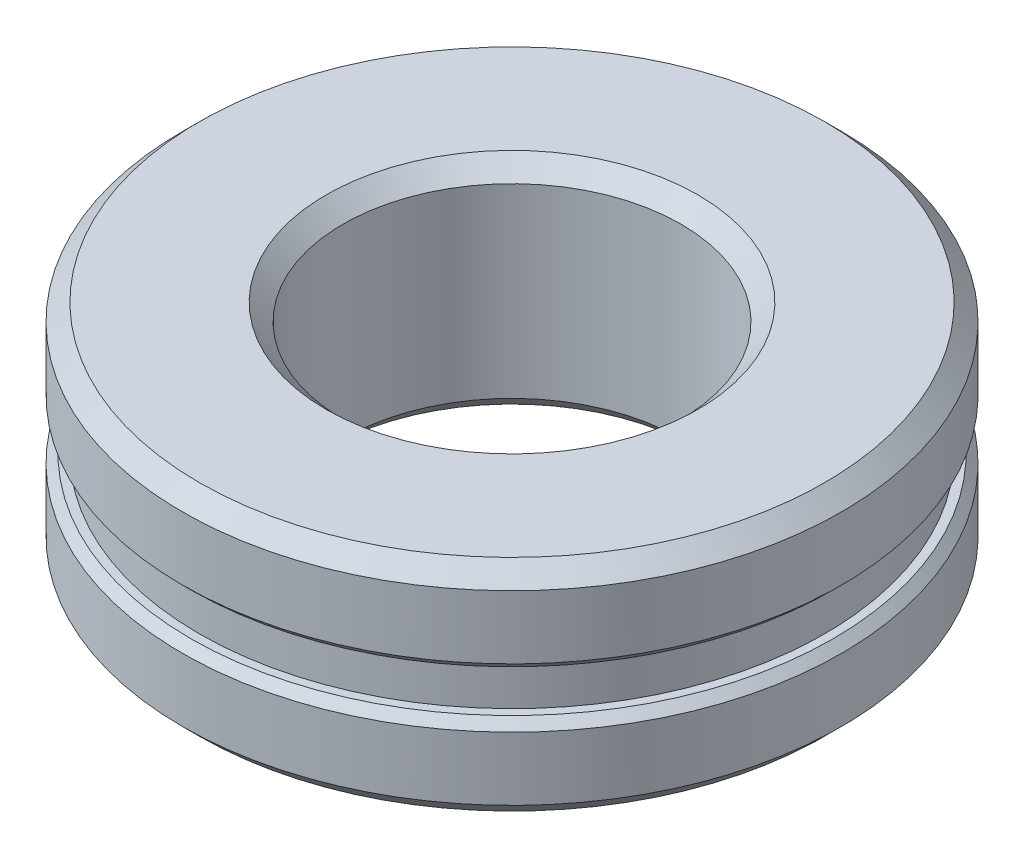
from build123d import *

# Parameters (mm, degrees)
CROQUIS1_R              = 39
CROQUIS1_R_2            = 20
SALIENTE_EXTRUIR1_DEPTH = 13
CHAFL_N1_SIZE           = 2
CROQUIS2_R              = 39
CROQUIS2_R_2            = 37
CORTAR_EXTRUIR1_DEPTH   = 2.5
CHAFL_N2_SIZE           = 1


with BuildPart() as part:
    # Croquis1 → Saliente-Extruir1 (new, symmetric)
    with BuildSketch(Plane(origin=(0, 0, 0), x_dir=(1, 0, 0), z_dir=(0, 1, 0))):
        with Locations(Location((0, 0, 0), (0, 0, 90))):
            Circle(CROQUIS1_R)
        with Locations(Location((0, 0, 0), (0, 0, 90))):
            Circle(CROQUIS1_R_2, mode=Mode.SUBTRACT)
    extrude(amount=SALIENTE_EXTRUIR1_DEPTH, both=True)

    # Chafl_n1
    chafl_n1_edges = [part.edges().sort_by_distance(p)[0] for p in [
        (0, -13, 39),
        (0, 13, 39),
        (0, -13, 20),
        (0, 13, 20),
    ]]
    chamfer(chafl_n1_edges, length=CHAFL_N1_SIZE)

    # Croquis2 → Cortar-Extruir1 (cut, symmetric)
    with BuildSketch(Plane(origin=(0, 0, 0), x_dir=(1, 0, 0), z_dir=(0, 1, 0))):
        with Locations(Location((0, 0, 0), (0, 0, 90))):
            Circle(CROQUIS2_R)
        with Locations(Location((0, 0, 0), (0, 0, 270))):
            Circle(CROQUIS2_R_2, mode=Mode.SUBTRACT)
    extrude(amount=CORTAR_EXTRUIR1_DEPTH, both=True, mode=Mode.SUBTRACT)

    # Chafl_n2
    chafl_n2_edges = [part.edges().sort_by_distance(p)[0] for p in [
        (0, -2.5, 39),
        (0, 2.5, 39),
    ]]
    chamfer(chafl_n2_edges, length=CHAFL_N2_SIZE)


solid = part.part
